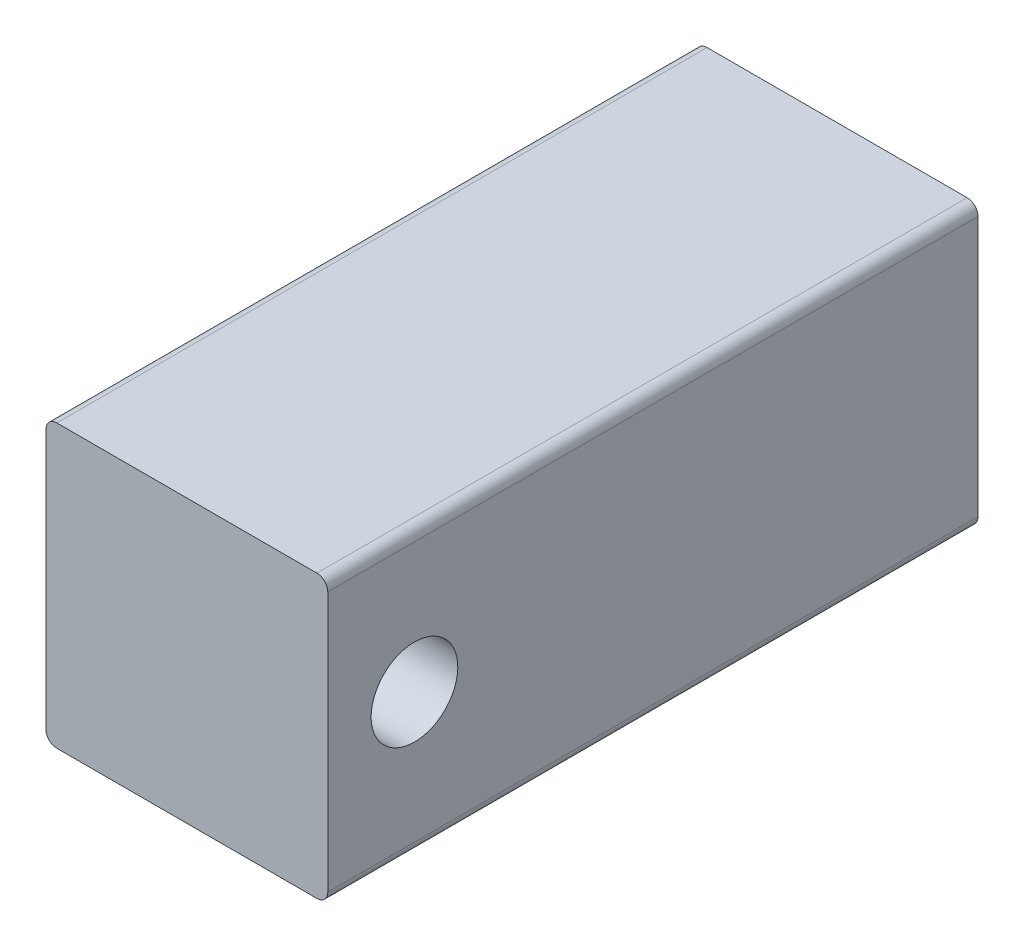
ISO-10303-21;
HEADER;
FILE_DESCRIPTION(('STEP AP214'),'2;1');
FILE_NAME('part.step','',(''),(''),'','','');
FILE_SCHEMA(('AUTOMOTIVE_DESIGN { 1 0 10303 214 1 1 1 1 }'));
ENDSEC;
DATA;
#1=APPLICATION_CONTEXT('core data for automotive mechanical design processes');
#2=APPLICATION_PROTOCOL_DEFINITION('international standard','automotive_design',2000,#1);
#3=PRODUCT_CONTEXT('',#1,'mechanical');
#4=PRODUCT('Part','Part','',(#3));
#5=PRODUCT_RELATED_PRODUCT_CATEGORY('part','',(#4));
#6=PRODUCT_DEFINITION_FORMATION('','',#4);
#7=PRODUCT_DEFINITION_CONTEXT('part definition',#1,'design');
#8=PRODUCT_DEFINITION('design','',#6,#7);
#9=PRODUCT_DEFINITION_SHAPE('','',#8);
#10=(LENGTH_UNIT() NAMED_UNIT(*) SI_UNIT(.MILLI.,.METRE.));
#11=(NAMED_UNIT(*) PLANE_ANGLE_UNIT() SI_UNIT($,.RADIAN.));
#12=(NAMED_UNIT(*) SI_UNIT($,.STERADIAN.) SOLID_ANGLE_UNIT());
#13=UNCERTAINTY_MEASURE_WITH_UNIT(LENGTH_MEASURE(1.E-05),#10,'distance_accuracy_value','');
#14=(GEOMETRIC_REPRESENTATION_CONTEXT(3) GLOBAL_UNCERTAINTY_ASSIGNED_CONTEXT((#13)) GLOBAL_UNIT_ASSIGNED_CONTEXT((#10,
#11,#12)) REPRESENTATION_CONTEXT('',''));
#15=CARTESIAN_POINT('',(0.,0.,0.));
#16=DIRECTION('',(0.,0.,1.));
#17=DIRECTION('',(1.,0.,0.));
#18=AXIS2_PLACEMENT_3D('',#15,#16,#17);
#19=CARTESIAN_POINT('',(6.,-6.,30.));
#20=DIRECTION('',(0.,0.,-1.));
#21=DIRECTION('',(-1.,0.,0.));
#22=AXIS2_PLACEMENT_3D('',#19,#20,#21);
#23=CYLINDRICAL_SURFACE('',#22,0.5);
#24=CARTESIAN_POINT('',(6.,-6.,0.));
#25=DIRECTION('',(0.,0.,1.));
#26=DIRECTION('',(1.,0.,0.));
#27=AXIS2_PLACEMENT_3D('',#24,#25,#26);
#28=CIRCLE('',#27,0.5);
#29=CARTESIAN_POINT('',(6.,-6.5,0.));
#30=VERTEX_POINT('',#29);
#31=CARTESIAN_POINT('',(6.5,-6.,0.));
#32=VERTEX_POINT('',#31);
#33=EDGE_CURVE('E135',#30,#32,#28,.T.);
#34=ORIENTED_EDGE('',*,*,#33,.T.);
#35=DIRECTION('',(0.,0.,-1.));
#36=VECTOR('',#35,1.);
#37=CARTESIAN_POINT('',(6.5,-6.,30.));
#38=LINE('',#37,#36);
#39=CARTESIAN_POINT('',(6.5,-6.,30.));
#40=VERTEX_POINT('',#39);
#41=EDGE_CURVE('E11',#40,#32,#38,.T.);
#42=ORIENTED_EDGE('',*,*,#41,.F.);
#43=CARTESIAN_POINT('',(6.,-6.,30.));
#44=DIRECTION('',(0.,0.,1.));
#45=DIRECTION('',(1.,0.,0.));
#46=AXIS2_PLACEMENT_3D('',#43,#44,#45);
#47=CIRCLE('',#46,0.5);
#48=CARTESIAN_POINT('',(6.,-6.5,30.));
#49=VERTEX_POINT('',#48);
#50=EDGE_CURVE('E150',#49,#40,#47,.T.);
#51=ORIENTED_EDGE('',*,*,#50,.F.);
#52=DIRECTION('',(0.,0.,-1.));
#53=VECTOR('',#52,1.);
#54=CARTESIAN_POINT('',(6.,-6.5,30.));
#55=LINE('',#54,#53);
#56=EDGE_CURVE('E131',#49,#30,#55,.T.);
#57=ORIENTED_EDGE('',*,*,#56,.T.);
#58=EDGE_LOOP('',(#34,#42,#51,#57));
#59=FACE_BOUND('',#58,.T.);
#60=ADVANCED_FACE('F37',(#59),#23,.T.);
#61=CARTESIAN_POINT('',(6.5,6.,30.));
#62=DIRECTION('',(-1.,0.,0.));
#63=DIRECTION('',(0.,-1.,0.));
#64=AXIS2_PLACEMENT_3D('',#61,#62,#63);
#65=PLANE('',#64);
#66=CARTESIAN_POINT('',(6.5,0.,26.));
#67=DIRECTION('',(1.,0.,0.));
#68=DIRECTION('',(0.,1.,0.));
#69=AXIS2_PLACEMENT_3D('',#66,#67,#68);
#70=CIRCLE('',#69,2.);
#71=CARTESIAN_POINT('',(6.5,2.,26.));
#72=VERTEX_POINT('',#71);
#73=EDGE_CURVE('E183',#72,#72,#70,.T.);
#74=ORIENTED_EDGE('',*,*,#73,.F.);
#75=EDGE_LOOP('',(#74));
#76=FACE_BOUND('',#75,.T.);
#77=DIRECTION('',(0.,1.,0.));
#78=VECTOR('',#77,1.);
#79=CARTESIAN_POINT('',(6.5,6.,0.));
#80=LINE('',#79,#78);
#81=CARTESIAN_POINT('',(6.5,6.,0.));
#82=VERTEX_POINT('',#81);
#83=EDGE_CURVE('E138',#32,#82,#80,.T.);
#84=ORIENTED_EDGE('',*,*,#83,.T.);
#85=DIRECTION('',(0.,0.,-1.));
#86=VECTOR('',#85,1.);
#87=CARTESIAN_POINT('',(6.5,6.,30.));
#88=LINE('',#87,#86);
#89=CARTESIAN_POINT('',(6.5,6.,30.));
#90=VERTEX_POINT('',#89);
#91=EDGE_CURVE('E45',#90,#82,#88,.T.);
#92=ORIENTED_EDGE('',*,*,#91,.F.);
#93=DIRECTION('',(0.,1.,0.));
#94=VECTOR('',#93,1.);
#95=CARTESIAN_POINT('',(6.5,6.,30.));
#96=LINE('',#95,#94);
#97=EDGE_CURVE('E97',#40,#90,#96,.T.);
#98=ORIENTED_EDGE('',*,*,#97,.F.);
#99=ORIENTED_EDGE('',*,*,#41,.T.);
#100=EDGE_LOOP('',(#84,#92,#98,#99));
#101=FACE_BOUND('',#100,.T.);
#102=ADVANCED_FACE('F211',(#76,#101),#65,.F.);
#103=CARTESIAN_POINT('',(6.,6.,30.));
#104=DIRECTION('',(0.,0.,-1.));
#105=DIRECTION('',(-1.,0.,0.));
#106=AXIS2_PLACEMENT_3D('',#103,#104,#105);
#107=CYLINDRICAL_SURFACE('',#106,0.5);
#108=CARTESIAN_POINT('',(6.,6.,0.));
#109=DIRECTION('',(0.,0.,1.));
#110=DIRECTION('',(-1.,0.,0.));
#111=AXIS2_PLACEMENT_3D('',#108,#109,#110);
#112=CIRCLE('',#111,0.5);
#113=CARTESIAN_POINT('',(5.99999999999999,6.5,0.));
#114=VERTEX_POINT('',#113);
#115=EDGE_CURVE('E141',#82,#114,#112,.T.);
#116=ORIENTED_EDGE('',*,*,#115,.T.);
#117=DIRECTION('',(0.,0.,-1.));
#118=VECTOR('',#117,1.);
#119=CARTESIAN_POINT('',(5.99999999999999,6.5,30.));
#120=LINE('',#119,#118);
#121=CARTESIAN_POINT('',(5.99999999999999,6.5,30.));
#122=VERTEX_POINT('',#121);
#123=EDGE_CURVE('E157',#122,#114,#120,.T.);
#124=ORIENTED_EDGE('',*,*,#123,.F.);
#125=CARTESIAN_POINT('',(6.,6.,30.));
#126=DIRECTION('',(0.,0.,1.));
#127=DIRECTION('',(-1.,0.,0.));
#128=AXIS2_PLACEMENT_3D('',#125,#126,#127);
#129=CIRCLE('',#128,0.5);
#130=EDGE_CURVE('E165',#90,#122,#129,.T.);
#131=ORIENTED_EDGE('',*,*,#130,.F.);
#132=ORIENTED_EDGE('',*,*,#91,.T.);
#133=EDGE_LOOP('',(#116,#124,#131,#132));
#134=FACE_BOUND('',#133,.T.);
#135=ADVANCED_FACE('F163',(#134),#107,.T.);
#136=CARTESIAN_POINT('',(-6.,6.5,30.));
#137=DIRECTION('',(0.,-1.,0.));
#138=DIRECTION('',(1.,0.,0.));
#139=AXIS2_PLACEMENT_3D('',#136,#137,#138);
#140=PLANE('',#139);
#141=DIRECTION('',(-1.,0.,0.));
#142=VECTOR('',#141,1.);
#143=CARTESIAN_POINT('',(-6.,6.5,0.));
#144=LINE('',#143,#142);
#145=CARTESIAN_POINT('',(-6.,6.5,0.));
#146=VERTEX_POINT('',#145);
#147=EDGE_CURVE('E143',#114,#146,#144,.T.);
#148=ORIENTED_EDGE('',*,*,#147,.T.);
#149=DIRECTION('',(0.,0.,-1.));
#150=VECTOR('',#149,1.);
#151=CARTESIAN_POINT('',(-6.,6.5,30.));
#152=LINE('',#151,#150);
#153=CARTESIAN_POINT('',(-6.,6.5,30.));
#154=VERTEX_POINT('',#153);
#155=EDGE_CURVE('E154',#154,#146,#152,.T.);
#156=ORIENTED_EDGE('',*,*,#155,.F.);
#157=DIRECTION('',(-1.,0.,0.));
#158=VECTOR('',#157,1.);
#159=CARTESIAN_POINT('',(-6.,6.5,30.));
#160=LINE('',#159,#158);
#161=EDGE_CURVE('E177',#122,#154,#160,.T.);
#162=ORIENTED_EDGE('',*,*,#161,.F.);
#163=ORIENTED_EDGE('',*,*,#123,.T.);
#164=EDGE_LOOP('',(#148,#156,#162,#163));
#165=FACE_BOUND('',#164,.T.);
#166=ADVANCED_FACE('F173',(#165),#140,.F.);
#167=CARTESIAN_POINT('',(-6.,6.,30.));
#168=DIRECTION('',(0.,0.,-1.));
#169=DIRECTION('',(-1.,0.,0.));
#170=AXIS2_PLACEMENT_3D('',#167,#168,#169);
#171=CYLINDRICAL_SURFACE('',#170,0.5);
#172=CARTESIAN_POINT('',(-6.,6.,0.));
#173=DIRECTION('',(0.,0.,1.));
#174=DIRECTION('',(1.,0.,0.));
#175=AXIS2_PLACEMENT_3D('',#172,#173,#174);
#176=CIRCLE('',#175,0.5);
#177=CARTESIAN_POINT('',(-6.5,5.99999999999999,0.));
#178=VERTEX_POINT('',#177);
#179=EDGE_CURVE('E145',#146,#178,#176,.T.);
#180=ORIENTED_EDGE('',*,*,#179,.T.);
#181=DIRECTION('',(0.,0.,-1.));
#182=VECTOR('',#181,1.);
#183=CARTESIAN_POINT('',(-6.5,5.99999999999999,30.));
#184=LINE('',#183,#182);
#185=CARTESIAN_POINT('',(-6.5,5.99999999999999,30.));
#186=VERTEX_POINT('',#185);
#187=EDGE_CURVE('E126',#186,#178,#184,.T.);
#188=ORIENTED_EDGE('',*,*,#187,.F.);
#189=CARTESIAN_POINT('',(-6.,6.,30.));
#190=DIRECTION('',(0.,0.,1.));
#191=DIRECTION('',(1.,0.,0.));
#192=AXIS2_PLACEMENT_3D('',#189,#190,#191);
#193=CIRCLE('',#192,0.5);
#194=EDGE_CURVE('E117',#154,#186,#193,.T.);
#195=ORIENTED_EDGE('',*,*,#194,.F.);
#196=ORIENTED_EDGE('',*,*,#155,.T.);
#197=EDGE_LOOP('',(#180,#188,#195,#196));
#198=FACE_BOUND('',#197,.T.);
#199=ADVANCED_FACE('F176',(#198),#171,.T.);
#200=CARTESIAN_POINT('',(-6.5,5.99999999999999,30.));
#201=DIRECTION('',(1.,0.,0.));
#202=DIRECTION('',(0.,1.,0.));
#203=AXIS2_PLACEMENT_3D('',#200,#201,#202);
#204=PLANE('',#203);
#205=CARTESIAN_POINT('',(-6.5,0.,26.));
#206=DIRECTION('',(1.,0.,0.));
#207=DIRECTION('',(0.,1.,0.));
#208=AXIS2_PLACEMENT_3D('',#205,#206,#207);
#209=CIRCLE('',#208,2.);
#210=CARTESIAN_POINT('',(-6.5,2.,26.));
#211=VERTEX_POINT('',#210);
#212=EDGE_CURVE('E139',#211,#211,#209,.T.);
#213=ORIENTED_EDGE('',*,*,#212,.T.);
#214=EDGE_LOOP('',(#213));
#215=FACE_BOUND('',#214,.T.);
#216=DIRECTION('',(0.,-1.,0.));
#217=VECTOR('',#216,1.);
#218=CARTESIAN_POINT('',(-6.5,5.99999999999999,0.));
#219=LINE('',#218,#217);
#220=CARTESIAN_POINT('',(-6.5,-6.,0.));
#221=VERTEX_POINT('',#220);
#222=EDGE_CURVE('E125',#178,#221,#219,.T.);
#223=ORIENTED_EDGE('',*,*,#222,.T.);
#224=DIRECTION('',(0.,0.,-1.));
#225=VECTOR('',#224,1.);
#226=CARTESIAN_POINT('',(-6.5,-6.,30.));
#227=LINE('',#226,#225);
#228=CARTESIAN_POINT('',(-6.5,-6.,30.));
#229=VERTEX_POINT('',#228);
#230=EDGE_CURVE('E122',#229,#221,#227,.T.);
#231=ORIENTED_EDGE('',*,*,#230,.F.);
#232=DIRECTION('',(0.,-1.,0.));
#233=VECTOR('',#232,1.);
#234=CARTESIAN_POINT('',(-6.5,5.99999999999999,30.));
#235=LINE('',#234,#233);
#236=EDGE_CURVE('E111',#186,#229,#235,.T.);
#237=ORIENTED_EDGE('',*,*,#236,.F.);
#238=ORIENTED_EDGE('',*,*,#187,.T.);
#239=EDGE_LOOP('',(#223,#231,#237,#238));
#240=FACE_BOUND('',#239,.T.);
#241=ADVANCED_FACE('F123',(#215,#240),#204,.F.);
#242=CARTESIAN_POINT('',(-6.,-6.,30.));
#243=DIRECTION('',(0.,0.,-1.));
#244=DIRECTION('',(-1.,0.,0.));
#245=AXIS2_PLACEMENT_3D('',#242,#243,#244);
#246=CYLINDRICAL_SURFACE('',#245,0.5);
#247=CARTESIAN_POINT('',(-6.,-6.,0.));
#248=DIRECTION('',(0.,0.,1.));
#249=DIRECTION('',(1.,0.,0.));
#250=AXIS2_PLACEMENT_3D('',#247,#248,#249);
#251=CIRCLE('',#250,0.5);
#252=CARTESIAN_POINT('',(-5.99999999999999,-6.5,0.));
#253=VERTEX_POINT('',#252);
#254=EDGE_CURVE('E83',#221,#253,#251,.T.);
#255=ORIENTED_EDGE('',*,*,#254,.T.);
#256=DIRECTION('',(0.,0.,-1.));
#257=VECTOR('',#256,1.);
#258=CARTESIAN_POINT('',(-5.99999999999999,-6.5,30.));
#259=LINE('',#258,#257);
#260=CARTESIAN_POINT('',(-5.99999999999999,-6.5,30.));
#261=VERTEX_POINT('',#260);
#262=EDGE_CURVE('E127',#261,#253,#259,.T.);
#263=ORIENTED_EDGE('',*,*,#262,.F.);
#264=CARTESIAN_POINT('',(-6.,-6.,30.));
#265=DIRECTION('',(0.,0.,1.));
#266=DIRECTION('',(1.,0.,0.));
#267=AXIS2_PLACEMENT_3D('',#264,#265,#266);
#268=CIRCLE('',#267,0.5);
#269=EDGE_CURVE('E115',#229,#261,#268,.T.);
#270=ORIENTED_EDGE('',*,*,#269,.F.);
#271=ORIENTED_EDGE('',*,*,#230,.T.);
#272=EDGE_LOOP('',(#255,#263,#270,#271));
#273=FACE_BOUND('',#272,.T.);
#274=ADVANCED_FACE('F129',(#273),#246,.T.);
#275=CARTESIAN_POINT('',(-5.99999999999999,-6.5,30.));
#276=DIRECTION('',(0.,1.,0.));
#277=DIRECTION('',(0.,0.,1.));
#278=AXIS2_PLACEMENT_3D('',#275,#276,#277);
#279=PLANE('',#278);
#280=DIRECTION('',(1.,0.,0.));
#281=VECTOR('',#280,1.);
#282=CARTESIAN_POINT('',(-5.99999999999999,-6.5,0.));
#283=LINE('',#282,#281);
#284=EDGE_CURVE('E89',#253,#30,#283,.T.);
#285=ORIENTED_EDGE('',*,*,#284,.T.);
#286=ORIENTED_EDGE('',*,*,#56,.F.);
#287=DIRECTION('',(1.,0.,0.));
#288=VECTOR('',#287,1.);
#289=CARTESIAN_POINT('',(-5.99999999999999,-6.5,30.));
#290=LINE('',#289,#288);
#291=EDGE_CURVE('E53',#261,#49,#290,.T.);
#292=ORIENTED_EDGE('',*,*,#291,.F.);
#293=ORIENTED_EDGE('',*,*,#262,.T.);
#294=EDGE_LOOP('',(#285,#286,#292,#293));
#295=FACE_BOUND('',#294,.T.);
#296=ADVANCED_FACE('F207',(#295),#279,.F.);
#297=CARTESIAN_POINT('',(6.,-6.,30.));
#298=DIRECTION('',(0.,0.,1.));
#299=DIRECTION('',(1.,0.,0.));
#300=AXIS2_PLACEMENT_3D('',#297,#298,#299);
#301=PLANE('',#300);
#302=ORIENTED_EDGE('',*,*,#50,.T.);
#303=ORIENTED_EDGE('',*,*,#97,.T.);
#304=ORIENTED_EDGE('',*,*,#130,.T.);
#305=ORIENTED_EDGE('',*,*,#161,.T.);
#306=ORIENTED_EDGE('',*,*,#194,.T.);
#307=ORIENTED_EDGE('',*,*,#236,.T.);
#308=ORIENTED_EDGE('',*,*,#269,.T.);
#309=ORIENTED_EDGE('',*,*,#291,.T.);
#310=EDGE_LOOP('',(#302,#303,#304,#305,#306,#307,#308,#309));
#311=FACE_BOUND('',#310,.T.);
#312=ADVANCED_FACE('F113',(#311),#301,.T.);
#313=CARTESIAN_POINT('',(6.,-6.,0.));
#314=DIRECTION('',(0.,0.,1.));
#315=DIRECTION('',(1.,0.,0.));
#316=AXIS2_PLACEMENT_3D('',#313,#314,#315);
#317=PLANE('',#316);
#318=CARTESIAN_POINT('',(0.,0.,0.));
#319=DIRECTION('',(0.,0.,-1.));
#320=DIRECTION('',(-1.,0.,0.));
#321=AXIS2_PLACEMENT_3D('',#318,#319,#320);
#322=CIRCLE('',#321,1.64999999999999);
#323=CARTESIAN_POINT('',(-1.64999999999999,0.,0.));
#324=VERTEX_POINT('',#323);
#325=EDGE_CURVE('E191',#324,#324,#322,.T.);
#326=ORIENTED_EDGE('',*,*,#325,.F.);
#327=EDGE_LOOP('',(#326));
#328=FACE_BOUND('',#327,.T.);
#329=ORIENTED_EDGE('',*,*,#33,.F.);
#330=ORIENTED_EDGE('',*,*,#284,.F.);
#331=ORIENTED_EDGE('',*,*,#254,.F.);
#332=ORIENTED_EDGE('',*,*,#222,.F.);
#333=ORIENTED_EDGE('',*,*,#179,.F.);
#334=ORIENTED_EDGE('',*,*,#147,.F.);
#335=ORIENTED_EDGE('',*,*,#115,.F.);
#336=ORIENTED_EDGE('',*,*,#83,.F.);
#337=EDGE_LOOP('',(#329,#330,#331,#332,#333,#334,#335,#336));
#338=FACE_BOUND('',#337,.T.);
#339=ADVANCED_FACE('F169',(#328,#338),#317,.F.);
#340=CARTESIAN_POINT('',(-6.5,0.,26.));
#341=DIRECTION('',(1.,0.,0.));
#342=DIRECTION('',(0.,1.,0.));
#343=AXIS2_PLACEMENT_3D('',#340,#341,#342);
#344=CYLINDRICAL_SURFACE('',#343,2.);
#345=ORIENTED_EDGE('',*,*,#212,.F.);
#346=EDGE_LOOP('',(#345));
#347=FACE_BOUND('',#346,.T.);
#348=ORIENTED_EDGE('',*,*,#73,.T.);
#349=EDGE_LOOP('',(#348));
#350=FACE_BOUND('',#349,.T.);
#351=ADVANCED_FACE('F198',(#347,#350),#344,.F.);
#352=CARTESIAN_POINT('',(0.,0.,22.));
#353=DIRECTION('',(0.,0.,-1.));
#354=DIRECTION('',(-1.,0.,0.));
#355=AXIS2_PLACEMENT_3D('',#352,#353,#354);
#356=CONICAL_SURFACE('',#355,1.65,1.02974425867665);
#357=CARTESIAN_POINT('',(0.,0.,22.9914200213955));
#358=VERTEX_POINT('',#357);
#359=VERTEX_LOOP('',#358);
#360=FACE_BOUND('',#359,.T.);
#361=CARTESIAN_POINT('',(0.,0.,22.));
#362=DIRECTION('',(0.,0.,-1.));
#363=DIRECTION('',(-1.,0.,0.));
#364=AXIS2_PLACEMENT_3D('',#361,#362,#363);
#365=CIRCLE('',#364,1.65);
#366=CARTESIAN_POINT('',(-1.65,0.,22.));
#367=VERTEX_POINT('',#366);
#368=EDGE_CURVE('E186',#367,#367,#365,.T.);
#369=ORIENTED_EDGE('',*,*,#368,.T.);
#370=EDGE_LOOP('',(#369));
#371=FACE_BOUND('',#370,.T.);
#372=ADVANCED_FACE('F204',(#360,#371),#356,.F.);
#373=CARTESIAN_POINT('',(0.,0.,0.));
#374=DIRECTION('',(0.,0.,-1.));
#375=DIRECTION('',(-1.,0.,0.));
#376=AXIS2_PLACEMENT_3D('',#373,#374,#375);
#377=CYLINDRICAL_SURFACE('',#376,1.64999999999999);
#378=ORIENTED_EDGE('',*,*,#368,.F.);
#379=EDGE_LOOP('',(#378));
#380=FACE_BOUND('',#379,.T.);
#381=ORIENTED_EDGE('',*,*,#325,.T.);
#382=EDGE_LOOP('',(#381));
#383=FACE_BOUND('',#382,.T.);
#384=ADVANCED_FACE('F195',(#380,#383),#377,.F.);
#385=CLOSED_SHELL('',(#60,#102,#135,#166,#199,#241,#274,#296,#312,#339,#351,#372,#384));
#386=MANIFOLD_SOLID_BREP('B2',#385);
#387=ADVANCED_BREP_SHAPE_REPRESENTATION('',(#18,#386),#14);
#388=SHAPE_DEFINITION_REPRESENTATION(#9,#387);
ENDSEC;
END-ISO-10303-21;
